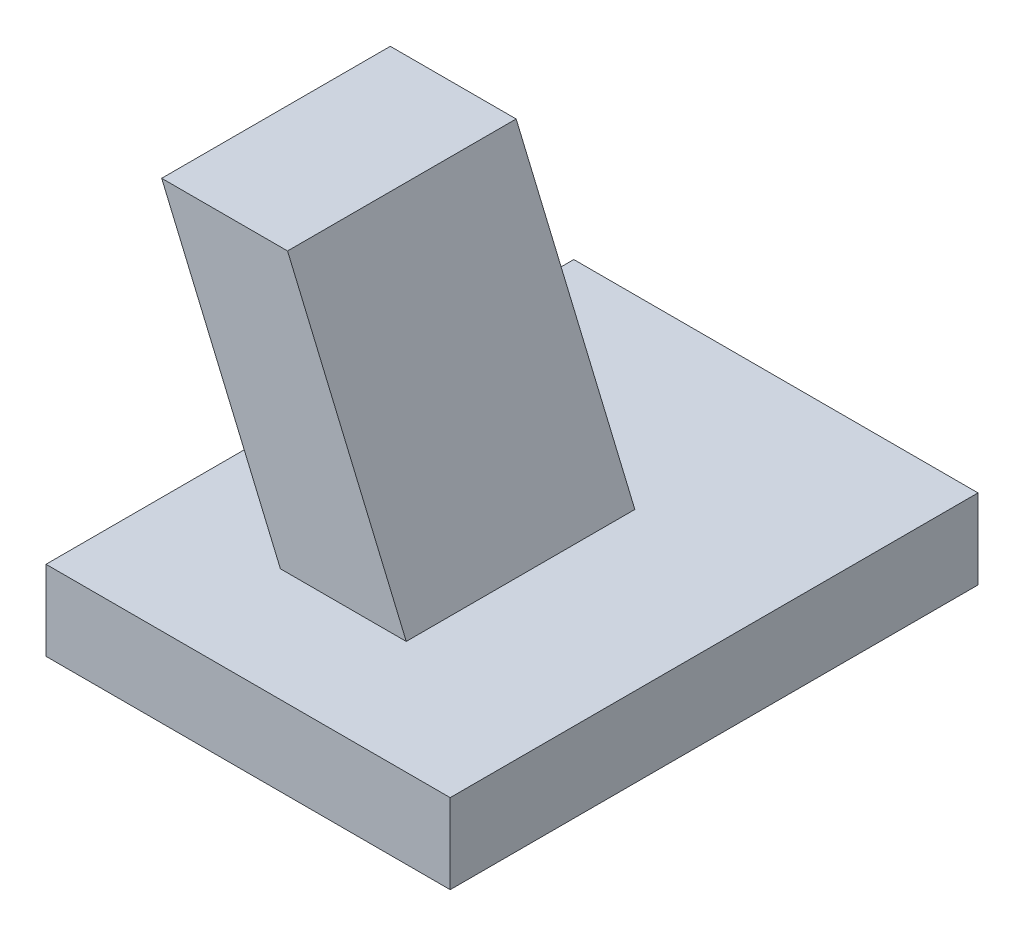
ISO-10303-21;
HEADER;
FILE_DESCRIPTION(('STEP AP214'),'2;1');
FILE_NAME('part.step','',(''),(''),'','','');
FILE_SCHEMA(('AUTOMOTIVE_DESIGN { 1 0 10303 214 1 1 1 1 }'));
ENDSEC;
DATA;
#1=APPLICATION_CONTEXT('core data for automotive mechanical design processes');
#2=APPLICATION_PROTOCOL_DEFINITION('international standard','automotive_design',2000,#1);
#3=PRODUCT_CONTEXT('',#1,'mechanical');
#4=PRODUCT('Part','Part','',(#3));
#5=PRODUCT_RELATED_PRODUCT_CATEGORY('part','',(#4));
#6=PRODUCT_DEFINITION_FORMATION('','',#4);
#7=PRODUCT_DEFINITION_CONTEXT('part definition',#1,'design');
#8=PRODUCT_DEFINITION('design','',#6,#7);
#9=PRODUCT_DEFINITION_SHAPE('','',#8);
#10=(LENGTH_UNIT() NAMED_UNIT(*) SI_UNIT(.MILLI.,.METRE.));
#11=(NAMED_UNIT(*) PLANE_ANGLE_UNIT() SI_UNIT($,.RADIAN.));
#12=(NAMED_UNIT(*) SI_UNIT($,.STERADIAN.) SOLID_ANGLE_UNIT());
#13=UNCERTAINTY_MEASURE_WITH_UNIT(LENGTH_MEASURE(1.E-05),#10,'distance_accuracy_value','');
#14=(GEOMETRIC_REPRESENTATION_CONTEXT(3) GLOBAL_UNCERTAINTY_ASSIGNED_CONTEXT((#13)) GLOBAL_UNIT_ASSIGNED_CONTEXT((#10,
#11,#12)) REPRESENTATION_CONTEXT('',''));
#15=CARTESIAN_POINT('',(0.,0.,0.));
#16=DIRECTION('',(0.,0.,1.));
#17=DIRECTION('',(1.,0.,0.));
#18=AXIS2_PLACEMENT_3D('',#15,#16,#17);
#19=CARTESIAN_POINT('',(-50.6824454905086,20.,-66.1847496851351));
#20=DIRECTION('',(0.,-1.,0.));
#21=DIRECTION('',(0.,0.,-1.));
#22=AXIS2_PLACEMENT_3D('',#19,#20,#21);
#23=PLANE('',#22);
#24=DIRECTION('',(0.,0.,1.));
#25=VECTOR('',#24,1.);
#26=CARTESIAN_POINT('',(-50.6824454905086,20.,66.1847496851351));
#27=LINE('',#26,#25);
#28=CARTESIAN_POINT('',(-50.6824454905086,20.,-66.1847496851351));
#29=VERTEX_POINT('',#28);
#30=CARTESIAN_POINT('',(-50.6824454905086,20.,66.1847496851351));
#31=VERTEX_POINT('',#30);
#32=EDGE_CURVE('E133',#29,#31,#27,.T.);
#33=ORIENTED_EDGE('',*,*,#32,.T.);
#34=DIRECTION('',(1.,0.,0.));
#35=VECTOR('',#34,1.);
#36=CARTESIAN_POINT('',(-50.6824454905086,20.,66.1847496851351));
#37=LINE('',#36,#35);
#38=CARTESIAN_POINT('',(50.6824454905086,20.,66.1847496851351));
#39=VERTEX_POINT('',#38);
#40=EDGE_CURVE('E136',#31,#39,#37,.T.);
#41=ORIENTED_EDGE('',*,*,#40,.T.);
#42=DIRECTION('',(0.,0.,-1.));
#43=VECTOR('',#42,1.);
#44=CARTESIAN_POINT('',(50.6824454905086,20.,66.1847496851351));
#45=LINE('',#44,#43);
#46=CARTESIAN_POINT('',(50.6824454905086,20.,-66.1847496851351));
#47=VERTEX_POINT('',#46);
#48=EDGE_CURVE('E138',#39,#47,#45,.T.);
#49=ORIENTED_EDGE('',*,*,#48,.T.);
#50=DIRECTION('',(-1.,0.,0.));
#51=VECTOR('',#50,1.);
#52=CARTESIAN_POINT('',(-50.6824454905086,20.,-66.1847496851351));
#53=LINE('',#52,#51);
#54=EDGE_CURVE('E140',#47,#29,#53,.T.);
#55=ORIENTED_EDGE('',*,*,#54,.T.);
#56=EDGE_LOOP('',(#33,#41,#49,#55));
#57=FACE_BOUND('',#56,.T.);
#58=DIRECTION('',(0.,0.,1.));
#59=VECTOR('',#58,1.);
#60=CARTESIAN_POINT('',(-20.3118335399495,20.,37.7741119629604));
#61=LINE('',#60,#59);
#62=CARTESIAN_POINT('',(-20.3118335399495,20.,-19.5569522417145));
#63=VERTEX_POINT('',#62);
#64=CARTESIAN_POINT('',(-20.3118335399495,20.,37.7741119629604));
#65=VERTEX_POINT('',#64);
#66=EDGE_CURVE('E118',#63,#65,#61,.T.);
#67=ORIENTED_EDGE('',*,*,#66,.F.);
#68=DIRECTION('',(-1.,0.,0.));
#69=VECTOR('',#68,1.);
#70=CARTESIAN_POINT('',(-20.3118335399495,20.,-19.5569522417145));
#71=LINE('',#70,#69);
#72=CARTESIAN_POINT('',(11.2522391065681,20.,-19.5569522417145));
#73=VERTEX_POINT('',#72);
#74=EDGE_CURVE('E115',#73,#63,#71,.T.);
#75=ORIENTED_EDGE('',*,*,#74,.F.);
#76=DIRECTION('',(0.,0.,-1.));
#77=VECTOR('',#76,1.);
#78=CARTESIAN_POINT('',(11.2522391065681,20.,37.7741119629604));
#79=LINE('',#78,#77);
#80=CARTESIAN_POINT('',(11.2522391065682,20.,37.7741119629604));
#81=VERTEX_POINT('',#80);
#82=EDGE_CURVE('E53',#81,#73,#79,.T.);
#83=ORIENTED_EDGE('',*,*,#82,.F.);
#84=DIRECTION('',(1.,0.,0.));
#85=VECTOR('',#84,1.);
#86=CARTESIAN_POINT('',(-20.3118335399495,20.,37.7741119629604));
#87=LINE('',#86,#85);
#88=EDGE_CURVE('E48',#65,#81,#87,.T.);
#89=ORIENTED_EDGE('',*,*,#88,.F.);
#90=EDGE_LOOP('',(#67,#75,#83,#89));
#91=FACE_BOUND('',#90,.T.);
#92=ADVANCED_FACE('F33',(#57,#91),#23,.F.);
#93=CARTESIAN_POINT('',(-50.6824454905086,20.,66.1847496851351));
#94=DIRECTION('',(1.,0.,0.));
#95=DIRECTION('',(0.,0.,-1.));
#96=AXIS2_PLACEMENT_3D('',#93,#94,#95);
#97=PLANE('',#96);
#98=DIRECTION('',(0.,0.,1.));
#99=VECTOR('',#98,1.);
#100=CARTESIAN_POINT('',(-50.6824454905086,0.,66.1847496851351));
#101=LINE('',#100,#99);
#102=CARTESIAN_POINT('',(-50.6824454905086,0.,-66.1847496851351));
#103=VERTEX_POINT('',#102);
#104=CARTESIAN_POINT('',(-50.6824454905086,0.,66.1847496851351));
#105=VERTEX_POINT('',#104);
#106=EDGE_CURVE('E119',#103,#105,#101,.T.);
#107=ORIENTED_EDGE('',*,*,#106,.T.);
#108=DIRECTION('',(0.,-1.,0.));
#109=VECTOR('',#108,1.);
#110=CARTESIAN_POINT('',(-50.6824454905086,20.,66.1847496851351));
#111=LINE('',#110,#109);
#112=EDGE_CURVE('E11',#31,#105,#111,.T.);
#113=ORIENTED_EDGE('',*,*,#112,.F.);
#114=ORIENTED_EDGE('',*,*,#32,.F.);
#115=DIRECTION('',(0.,-1.,0.));
#116=VECTOR('',#115,1.);
#117=CARTESIAN_POINT('',(-50.6824454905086,20.,-66.1847496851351));
#118=LINE('',#117,#116);
#119=EDGE_CURVE('E142',#29,#103,#118,.T.);
#120=ORIENTED_EDGE('',*,*,#119,.T.);
#121=EDGE_LOOP('',(#107,#113,#114,#120));
#122=FACE_BOUND('',#121,.T.);
#123=ADVANCED_FACE('F35',(#122),#97,.F.);
#124=CARTESIAN_POINT('',(-50.6824454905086,20.,66.1847496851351));
#125=DIRECTION('',(0.,0.,-1.));
#126=DIRECTION('',(-1.,0.,0.));
#127=AXIS2_PLACEMENT_3D('',#124,#125,#126);
#128=PLANE('',#127);
#129=DIRECTION('',(1.,0.,0.));
#130=VECTOR('',#129,1.);
#131=CARTESIAN_POINT('',(-50.6824454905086,0.,66.1847496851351));
#132=LINE('',#131,#130);
#133=CARTESIAN_POINT('',(50.6824454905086,0.,66.1847496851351));
#134=VERTEX_POINT('',#133);
#135=EDGE_CURVE('E122',#105,#134,#132,.T.);
#136=ORIENTED_EDGE('',*,*,#135,.T.);
#137=DIRECTION('',(0.,-1.,0.));
#138=VECTOR('',#137,1.);
#139=CARTESIAN_POINT('',(50.6824454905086,20.,66.1847496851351));
#140=LINE('',#139,#138);
#141=EDGE_CURVE('E41',#39,#134,#140,.T.);
#142=ORIENTED_EDGE('',*,*,#141,.F.);
#143=ORIENTED_EDGE('',*,*,#40,.F.);
#144=ORIENTED_EDGE('',*,*,#112,.T.);
#145=EDGE_LOOP('',(#136,#142,#143,#144));
#146=FACE_BOUND('',#145,.T.);
#147=ADVANCED_FACE('F167',(#146),#128,.F.);
#148=CARTESIAN_POINT('',(50.6824454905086,20.,66.1847496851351));
#149=DIRECTION('',(-1.,0.,0.));
#150=DIRECTION('',(0.,0.,1.));
#151=AXIS2_PLACEMENT_3D('',#148,#149,#150);
#152=PLANE('',#151);
#153=DIRECTION('',(0.,0.,-1.));
#154=VECTOR('',#153,1.);
#155=CARTESIAN_POINT('',(50.6824454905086,0.,66.1847496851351));
#156=LINE('',#155,#154);
#157=CARTESIAN_POINT('',(50.6824454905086,0.,-66.1847496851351));
#158=VERTEX_POINT('',#157);
#159=EDGE_CURVE('E129',#134,#158,#156,.T.);
#160=ORIENTED_EDGE('',*,*,#159,.T.);
#161=DIRECTION('',(0.,-1.,0.));
#162=VECTOR('',#161,1.);
#163=CARTESIAN_POINT('',(50.6824454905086,20.,-66.1847496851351));
#164=LINE('',#163,#162);
#165=EDGE_CURVE('E145',#47,#158,#164,.T.);
#166=ORIENTED_EDGE('',*,*,#165,.F.);
#167=ORIENTED_EDGE('',*,*,#48,.F.);
#168=ORIENTED_EDGE('',*,*,#141,.T.);
#169=EDGE_LOOP('',(#160,#166,#167,#168));
#170=FACE_BOUND('',#169,.T.);
#171=ADVANCED_FACE('F152',(#170),#152,.F.);
#172=CARTESIAN_POINT('',(-50.6824454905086,20.,-66.1847496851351));
#173=DIRECTION('',(0.,0.,1.));
#174=DIRECTION('',(1.,0.,0.));
#175=AXIS2_PLACEMENT_3D('',#172,#173,#174);
#176=PLANE('',#175);
#177=DIRECTION('',(-1.,0.,0.));
#178=VECTOR('',#177,1.);
#179=CARTESIAN_POINT('',(-50.6824454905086,0.,-66.1847496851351));
#180=LINE('',#179,#178);
#181=EDGE_CURVE('E131',#158,#103,#180,.T.);
#182=ORIENTED_EDGE('',*,*,#181,.T.);
#183=ORIENTED_EDGE('',*,*,#119,.F.);
#184=ORIENTED_EDGE('',*,*,#54,.F.);
#185=ORIENTED_EDGE('',*,*,#165,.T.);
#186=EDGE_LOOP('',(#182,#183,#184,#185));
#187=FACE_BOUND('',#186,.T.);
#188=ADVANCED_FACE('F161',(#187),#176,.F.);
#189=CARTESIAN_POINT('',(-50.6824454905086,0.,-66.1847496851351));
#190=DIRECTION('',(0.,-1.,0.));
#191=DIRECTION('',(0.,0.,-1.));
#192=AXIS2_PLACEMENT_3D('',#189,#190,#191);
#193=PLANE('',#192);
#194=ORIENTED_EDGE('',*,*,#106,.F.);
#195=ORIENTED_EDGE('',*,*,#181,.F.);
#196=ORIENTED_EDGE('',*,*,#159,.F.);
#197=ORIENTED_EDGE('',*,*,#135,.F.);
#198=EDGE_LOOP('',(#194,#195,#196,#197));
#199=FACE_BOUND('',#198,.T.);
#200=ADVANCED_FACE('F158',(#199),#193,.T.);
#201=CARTESIAN_POINT('',(-50.0811559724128,89.9270151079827,37.7741119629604));
#202=DIRECTION('',(0.920092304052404,0.391701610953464,0.));
#203=DIRECTION('',(-0.391701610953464,0.920092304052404,0.));
#204=AXIS2_PLACEMENT_3D('',#201,#202,#203);
#205=PLANE('',#204);
#206=ORIENTED_EDGE('',*,*,#66,.T.);
#207=DIRECTION('',(0.391701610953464,-0.920092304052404,0.));
#208=VECTOR('',#207,1.);
#209=CARTESIAN_POINT('',(-50.0811559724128,89.9270151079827,37.7741119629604));
#210=LINE('',#209,#208);
#211=CARTESIAN_POINT('',(-50.0811559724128,89.9270151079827,37.7741119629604));
#212=VERTEX_POINT('',#211);
#213=EDGE_CURVE('E99',#212,#65,#210,.T.);
#214=ORIENTED_EDGE('',*,*,#213,.F.);
#215=DIRECTION('',(0.,0.,1.));
#216=VECTOR('',#215,1.);
#217=CARTESIAN_POINT('',(-50.0811559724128,89.9270151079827,37.7741119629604));
#218=LINE('',#217,#216);
#219=CARTESIAN_POINT('',(-50.0811559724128,89.9270151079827,-19.5569522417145));
#220=VERTEX_POINT('',#219);
#221=EDGE_CURVE('E106',#220,#212,#218,.T.);
#222=ORIENTED_EDGE('',*,*,#221,.F.);
#223=DIRECTION('',(0.391701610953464,-0.920092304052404,0.));
#224=VECTOR('',#223,1.);
#225=CARTESIAN_POINT('',(-50.0811559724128,89.9270151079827,-19.5569522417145));
#226=LINE('',#225,#224);
#227=EDGE_CURVE('E260',#220,#63,#226,.T.);
#228=ORIENTED_EDGE('',*,*,#227,.T.);
#229=EDGE_LOOP('',(#206,#214,#222,#228));
#230=FACE_BOUND('',#229,.T.);
#231=ADVANCED_FACE('F117',(#230),#205,.F.);
#232=CARTESIAN_POINT('',(-50.0811559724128,89.9270151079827,37.7741119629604));
#233=DIRECTION('',(0.,0.,-1.));
#234=DIRECTION('',(-1.,0.,0.));
#235=AXIS2_PLACEMENT_3D('',#232,#233,#234);
#236=PLANE('',#235);
#237=ORIENTED_EDGE('',*,*,#88,.T.);
#238=DIRECTION('',(0.391701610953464,-0.920092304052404,0.));
#239=VECTOR('',#238,1.);
#240=CARTESIAN_POINT('',(-18.5170833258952,89.9270151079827,37.7741119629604));
#241=LINE('',#240,#239);
#242=CARTESIAN_POINT('',(-18.5170833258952,89.9270151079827,37.7741119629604));
#243=VERTEX_POINT('',#242);
#244=EDGE_CURVE('E102',#243,#81,#241,.T.);
#245=ORIENTED_EDGE('',*,*,#244,.F.);
#246=DIRECTION('',(1.,0.,0.));
#247=VECTOR('',#246,1.);
#248=CARTESIAN_POINT('',(-50.0811559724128,89.9270151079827,37.7741119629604));
#249=LINE('',#248,#247);
#250=EDGE_CURVE('E95',#212,#243,#249,.T.);
#251=ORIENTED_EDGE('',*,*,#250,.F.);
#252=ORIENTED_EDGE('',*,*,#213,.T.);
#253=EDGE_LOOP('',(#237,#245,#251,#252));
#254=FACE_BOUND('',#253,.T.);
#255=ADVANCED_FACE('F97',(#254),#236,.F.);
#256=CARTESIAN_POINT('',(-18.5170833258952,89.9270151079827,37.7741119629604));
#257=DIRECTION('',(-0.920092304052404,-0.391701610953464,0.));
#258=DIRECTION('',(0.391701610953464,-0.920092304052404,0.));
#259=AXIS2_PLACEMENT_3D('',#256,#257,#258);
#260=PLANE('',#259);
#261=ORIENTED_EDGE('',*,*,#82,.T.);
#262=DIRECTION('',(0.391701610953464,-0.920092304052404,0.));
#263=VECTOR('',#262,1.);
#264=CARTESIAN_POINT('',(-18.5170833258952,89.9270151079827,-19.5569522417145));
#265=LINE('',#264,#263);
#266=CARTESIAN_POINT('',(-18.5170833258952,89.9270151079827,-19.5569522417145));
#267=VERTEX_POINT('',#266);
#268=EDGE_CURVE('E124',#267,#73,#265,.T.);
#269=ORIENTED_EDGE('',*,*,#268,.F.);
#270=DIRECTION('',(0.,0.,-1.));
#271=VECTOR('',#270,1.);
#272=CARTESIAN_POINT('',(-18.5170833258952,89.9270151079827,37.7741119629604));
#273=LINE('',#272,#271);
#274=EDGE_CURVE('E105',#243,#267,#273,.T.);
#275=ORIENTED_EDGE('',*,*,#274,.F.);
#276=ORIENTED_EDGE('',*,*,#244,.T.);
#277=EDGE_LOOP('',(#261,#269,#275,#276));
#278=FACE_BOUND('',#277,.T.);
#279=ADVANCED_FACE('F191',(#278),#260,.F.);
#280=CARTESIAN_POINT('',(-50.0811559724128,89.9270151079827,-19.5569522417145));
#281=DIRECTION('',(0.,0.,1.));
#282=DIRECTION('',(1.,0.,0.));
#283=AXIS2_PLACEMENT_3D('',#280,#281,#282);
#284=PLANE('',#283);
#285=ORIENTED_EDGE('',*,*,#74,.T.);
#286=ORIENTED_EDGE('',*,*,#227,.F.);
#287=DIRECTION('',(-1.,0.,0.));
#288=VECTOR('',#287,1.);
#289=CARTESIAN_POINT('',(-50.0811559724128,89.9270151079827,-19.5569522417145));
#290=LINE('',#289,#288);
#291=EDGE_CURVE('E111',#267,#220,#290,.T.);
#292=ORIENTED_EDGE('',*,*,#291,.F.);
#293=ORIENTED_EDGE('',*,*,#268,.T.);
#294=EDGE_LOOP('',(#285,#286,#292,#293));
#295=FACE_BOUND('',#294,.T.);
#296=ADVANCED_FACE('F196',(#295),#284,.F.);
#297=CARTESIAN_POINT('',(-50.0811559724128,89.9270151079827,-19.5569522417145));
#298=DIRECTION('',(0.,-1.,0.));
#299=DIRECTION('',(0.,0.,-1.));
#300=AXIS2_PLACEMENT_3D('',#297,#298,#299);
#301=PLANE('',#300);
#302=ORIENTED_EDGE('',*,*,#221,.T.);
#303=ORIENTED_EDGE('',*,*,#250,.T.);
#304=ORIENTED_EDGE('',*,*,#274,.T.);
#305=ORIENTED_EDGE('',*,*,#291,.T.);
#306=EDGE_LOOP('',(#302,#303,#304,#305));
#307=FACE_BOUND('',#306,.T.);
#308=ADVANCED_FACE('F109',(#307),#301,.F.);
#309=CLOSED_SHELL('',(#92,#123,#147,#171,#188,#200,#231,#255,#279,#296,#308));
#310=MANIFOLD_SOLID_BREP('B2',#309);
#311=ADVANCED_BREP_SHAPE_REPRESENTATION('',(#18,#310),#14);
#312=SHAPE_DEFINITION_REPRESENTATION(#9,#311);
ENDSEC;
END-ISO-10303-21;
